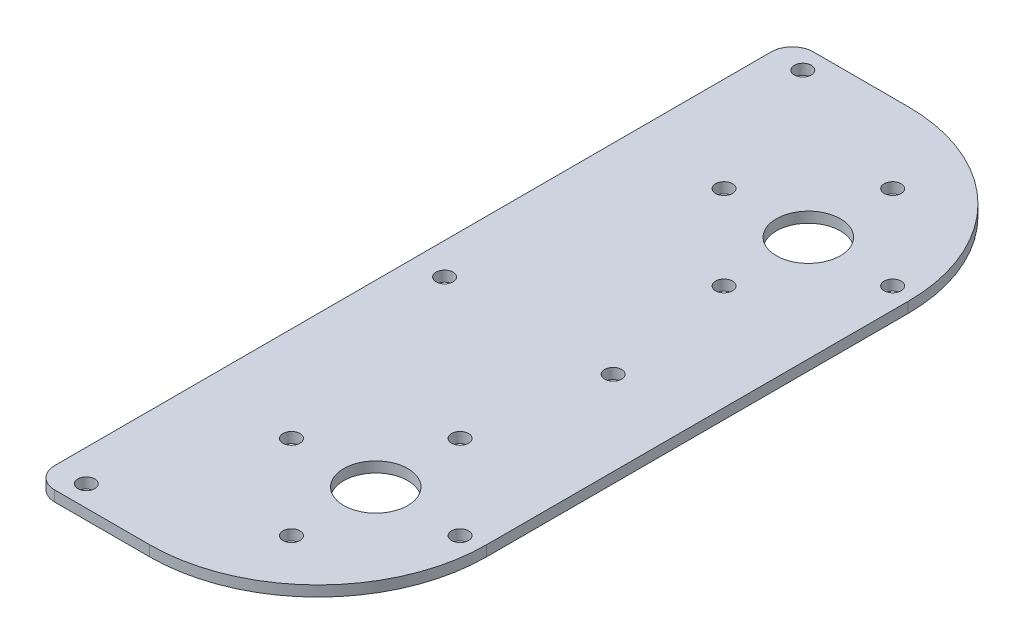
ISO-10303-21;
HEADER;
FILE_DESCRIPTION(('STEP AP214'),'2;1');
FILE_NAME('part.step','',(''),(''),'','','');
FILE_SCHEMA(('AUTOMOTIVE_DESIGN { 1 0 10303 214 1 1 1 1 }'));
ENDSEC;
DATA;
#1=APPLICATION_CONTEXT('core data for automotive mechanical design processes');
#2=APPLICATION_PROTOCOL_DEFINITION('international standard','automotive_design',2000,#1);
#3=PRODUCT_CONTEXT('',#1,'mechanical');
#4=PRODUCT('Part','Part','',(#3));
#5=PRODUCT_RELATED_PRODUCT_CATEGORY('part','',(#4));
#6=PRODUCT_DEFINITION_FORMATION('','',#4);
#7=PRODUCT_DEFINITION_CONTEXT('part definition',#1,'design');
#8=PRODUCT_DEFINITION('design','',#6,#7);
#9=PRODUCT_DEFINITION_SHAPE('','',#8);
#10=(LENGTH_UNIT() NAMED_UNIT(*) SI_UNIT(.MILLI.,.METRE.));
#11=(NAMED_UNIT(*) PLANE_ANGLE_UNIT() SI_UNIT($,.RADIAN.));
#12=(NAMED_UNIT(*) SI_UNIT($,.STERADIAN.) SOLID_ANGLE_UNIT());
#13=UNCERTAINTY_MEASURE_WITH_UNIT(LENGTH_MEASURE(1.E-05),#10,'distance_accuracy_value','');
#14=(GEOMETRIC_REPRESENTATION_CONTEXT(3) GLOBAL_UNCERTAINTY_ASSIGNED_CONTEXT((#13)) GLOBAL_UNIT_ASSIGNED_CONTEXT((#10,
#11,#12)) REPRESENTATION_CONTEXT('',''));
#15=CARTESIAN_POINT('',(0.,0.,0.));
#16=DIRECTION('',(0.,0.,1.));
#17=DIRECTION('',(1.,0.,0.));
#18=AXIS2_PLACEMENT_3D('',#15,#16,#17);
#19=CARTESIAN_POINT('',(6.35,3.175,-6.35));
#20=DIRECTION('',(0.,1.,0.));
#21=DIRECTION('',(0.,0.,1.));
#22=AXIS2_PLACEMENT_3D('',#19,#20,#21);
#23=PLANE('',#22);
#24=DIRECTION('',(0.,0.,-1.));
#25=VECTOR('',#24,1.);
#26=CARTESIAN_POINT('',(9.525,3.175,-228.6));
#27=LINE('',#26,#25);
#28=CARTESIAN_POINT('',(9.52500000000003,3.175,-6.34999999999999));
#29=VERTEX_POINT('',#28);
#30=CARTESIAN_POINT('',(9.525,3.175,-222.25));
#31=VERTEX_POINT('',#30);
#32=EDGE_CURVE('E198',#29,#31,#27,.T.);
#33=ORIENTED_EDGE('',*,*,#32,.F.);
#34=CARTESIAN_POINT('',(15.875,3.175,-6.34999999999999));
#35=DIRECTION('',(0.,1.,0.));
#36=DIRECTION('',(0.,0.,1.));
#37=AXIS2_PLACEMENT_3D('',#34,#35,#36);
#38=CIRCLE('',#37,6.35);
#39=CARTESIAN_POINT('',(15.875,3.175,0.));
#40=VERTEX_POINT('',#39);
#41=EDGE_CURVE('E122',#29,#40,#38,.T.);
#42=ORIENTED_EDGE('',*,*,#41,.T.);
#43=DIRECTION('',(1.,0.,0.));
#44=VECTOR('',#43,1.);
#45=CARTESIAN_POINT('',(6.35000000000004,3.175,0.));
#46=LINE('',#45,#44);
#47=CARTESIAN_POINT('',(44.45,3.175,0.));
#48=VERTEX_POINT('',#47);
#49=EDGE_CURVE('E115',#40,#48,#46,.T.);
#50=ORIENTED_EDGE('',*,*,#49,.T.);
#51=CARTESIAN_POINT('',(44.45,3.175,-50.8));
#52=DIRECTION('',(0.,1.,0.));
#53=DIRECTION('',(0.,0.,1.));
#54=AXIS2_PLACEMENT_3D('',#51,#52,#53);
#55=CIRCLE('',#54,50.8);
#56=CARTESIAN_POINT('',(95.25,3.175,-50.8));
#57=VERTEX_POINT('',#56);
#58=EDGE_CURVE('E120',#48,#57,#55,.T.);
#59=ORIENTED_EDGE('',*,*,#58,.T.);
#60=DIRECTION('',(0.,0.,-1.));
#61=VECTOR('',#60,1.);
#62=CARTESIAN_POINT('',(95.25,3.175,-50.8));
#63=LINE('',#62,#61);
#64=CARTESIAN_POINT('',(95.25,3.175,-177.8));
#65=VERTEX_POINT('',#64);
#66=EDGE_CURVE('E140',#57,#65,#63,.T.);
#67=ORIENTED_EDGE('',*,*,#66,.T.);
#68=CARTESIAN_POINT('',(44.45,3.175,-177.8));
#69=DIRECTION('',(0.,1.,0.));
#70=DIRECTION('',(0.,0.,1.));
#71=AXIS2_PLACEMENT_3D('',#68,#69,#70);
#72=CIRCLE('',#71,50.8);
#73=CARTESIAN_POINT('',(44.45,3.175,-228.6));
#74=VERTEX_POINT('',#73);
#75=EDGE_CURVE('E145',#65,#74,#72,.T.);
#76=ORIENTED_EDGE('',*,*,#75,.T.);
#77=DIRECTION('',(-1.,0.,0.));
#78=VECTOR('',#77,1.);
#79=CARTESIAN_POINT('',(6.35,3.175,-228.6));
#80=LINE('',#79,#78);
#81=CARTESIAN_POINT('',(15.875,3.175,-228.6));
#82=VERTEX_POINT('',#81);
#83=EDGE_CURVE('E151',#74,#82,#80,.T.);
#84=ORIENTED_EDGE('',*,*,#83,.T.);
#85=CARTESIAN_POINT('',(15.875,3.175,-222.25));
#86=DIRECTION('',(0.,1.,0.));
#87=DIRECTION('',(0.,0.,1.));
#88=AXIS2_PLACEMENT_3D('',#85,#86,#87);
#89=CIRCLE('',#88,6.35);
#90=EDGE_CURVE('E182',#82,#31,#89,.T.);
#91=ORIENTED_EDGE('',*,*,#90,.T.);
#92=EDGE_LOOP('',(#33,#42,#50,#59,#67,#76,#84,#91));
#93=FACE_BOUND('',#92,.T.);
#94=CARTESIAN_POINT('',(63.5,3.175,-204.8764));
#95=DIRECTION('',(0.,1.,0.));
#96=DIRECTION('',(0.,0.,1.));
#97=AXIS2_PLACEMENT_3D('',#94,#95,#96);
#98=CIRCLE('',#97,2.55269999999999);
#99=CARTESIAN_POINT('',(63.5,3.175,-202.3237));
#100=VERTEX_POINT('',#99);
#101=EDGE_CURVE('E197',#100,#100,#98,.T.);
#102=ORIENTED_EDGE('',*,*,#101,.F.);
#103=EDGE_LOOP('',(#102));
#104=FACE_BOUND('',#103,.T.);
#105=CARTESIAN_POINT('',(38.1,3.175,-179.4764));
#106=DIRECTION('',(0.,1.,0.));
#107=DIRECTION('',(0.,0.,1.));
#108=AXIS2_PLACEMENT_3D('',#105,#106,#107);
#109=CIRCLE('',#108,2.55269999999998);
#110=CARTESIAN_POINT('',(38.1,3.175,-176.9237));
#111=VERTEX_POINT('',#110);
#112=EDGE_CURVE('E572',#111,#111,#109,.T.);
#113=ORIENTED_EDGE('',*,*,#112,.F.);
#114=EDGE_LOOP('',(#113));
#115=FACE_BOUND('',#114,.T.);
#116=CARTESIAN_POINT('',(88.9,3.175,-179.4764));
#117=DIRECTION('',(0.,1.,0.));
#118=DIRECTION('',(0.,0.,1.));
#119=AXIS2_PLACEMENT_3D('',#116,#117,#118);
#120=CIRCLE('',#119,2.55269999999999);
#121=CARTESIAN_POINT('',(88.9,3.175,-176.9237));
#122=VERTEX_POINT('',#121);
#123=EDGE_CURVE('E564',#122,#122,#120,.T.);
#124=ORIENTED_EDGE('',*,*,#123,.F.);
#125=EDGE_LOOP('',(#124));
#126=FACE_BOUND('',#125,.T.);
#127=CARTESIAN_POINT('',(63.5,3.175,-154.0764));
#128=DIRECTION('',(0.,1.,0.));
#129=DIRECTION('',(0.,0.,1.));
#130=AXIS2_PLACEMENT_3D('',#127,#128,#129);
#131=CIRCLE('',#130,2.55269999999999);
#132=CARTESIAN_POINT('',(63.5,3.175,-151.5237));
#133=VERTEX_POINT('',#132);
#134=EDGE_CURVE('E556',#133,#133,#131,.T.);
#135=ORIENTED_EDGE('',*,*,#134,.F.);
#136=EDGE_LOOP('',(#135));
#137=FACE_BOUND('',#136,.T.);
#138=CARTESIAN_POINT('',(63.5,3.175,-74.5236));
#139=DIRECTION('',(0.,1.,0.));
#140=DIRECTION('',(0.,0.,1.));
#141=AXIS2_PLACEMENT_3D('',#138,#139,#140);
#142=CIRCLE('',#141,2.55269999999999);
#143=CARTESIAN_POINT('',(63.5,3.175,-71.9709));
#144=VERTEX_POINT('',#143);
#145=EDGE_CURVE('E548',#144,#144,#142,.T.);
#146=ORIENTED_EDGE('',*,*,#145,.F.);
#147=EDGE_LOOP('',(#146));
#148=FACE_BOUND('',#147,.T.);
#149=CARTESIAN_POINT('',(38.1,3.175,-49.1236));
#150=DIRECTION('',(0.,1.,0.));
#151=DIRECTION('',(0.,0.,1.));
#152=AXIS2_PLACEMENT_3D('',#149,#150,#151);
#153=CIRCLE('',#152,2.55269999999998);
#154=CARTESIAN_POINT('',(38.1,3.175,-46.5709));
#155=VERTEX_POINT('',#154);
#156=EDGE_CURVE('E540',#155,#155,#153,.T.);
#157=ORIENTED_EDGE('',*,*,#156,.F.);
#158=EDGE_LOOP('',(#157));
#159=FACE_BOUND('',#158,.T.);
#160=CARTESIAN_POINT('',(88.9,3.175,-49.1236));
#161=DIRECTION('',(0.,1.,0.));
#162=DIRECTION('',(0.,0.,1.));
#163=AXIS2_PLACEMENT_3D('',#160,#161,#162);
#164=CIRCLE('',#163,2.55269999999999);
#165=CARTESIAN_POINT('',(88.9,3.175,-46.5709));
#166=VERTEX_POINT('',#165);
#167=EDGE_CURVE('E532',#166,#166,#164,.T.);
#168=ORIENTED_EDGE('',*,*,#167,.F.);
#169=EDGE_LOOP('',(#168));
#170=FACE_BOUND('',#169,.T.);
#171=CARTESIAN_POINT('',(63.5,3.175,-23.7236));
#172=DIRECTION('',(0.,1.,0.));
#173=DIRECTION('',(0.,0.,1.));
#174=AXIS2_PLACEMENT_3D('',#171,#172,#173);
#175=CIRCLE('',#174,2.55269999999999);
#176=CARTESIAN_POINT('',(63.5,3.175,-21.1709));
#177=VERTEX_POINT('',#176);
#178=EDGE_CURVE('E524',#177,#177,#175,.T.);
#179=ORIENTED_EDGE('',*,*,#178,.F.);
#180=EDGE_LOOP('',(#179));
#181=FACE_BOUND('',#180,.T.);
#182=CARTESIAN_POINT('',(19.05,3.175,-222.25));
#183=DIRECTION('',(0.,1.,0.));
#184=DIRECTION('',(0.,0.,1.));
#185=AXIS2_PLACEMENT_3D('',#182,#183,#184);
#186=CIRCLE('',#185,2.55269999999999);
#187=CARTESIAN_POINT('',(19.05,3.175,-219.6973));
#188=VERTEX_POINT('',#187);
#189=EDGE_CURVE('E516',#188,#188,#186,.T.);
#190=ORIENTED_EDGE('',*,*,#189,.F.);
#191=EDGE_LOOP('',(#190));
#192=FACE_BOUND('',#191,.T.);
#193=CARTESIAN_POINT('',(19.05,3.175,-114.3));
#194=DIRECTION('',(0.,1.,0.));
#195=DIRECTION('',(0.,0.,1.));
#196=AXIS2_PLACEMENT_3D('',#193,#194,#195);
#197=CIRCLE('',#196,2.55269999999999);
#198=CARTESIAN_POINT('',(19.05,3.175,-111.7473));
#199=VERTEX_POINT('',#198);
#200=EDGE_CURVE('E508',#199,#199,#197,.T.);
#201=ORIENTED_EDGE('',*,*,#200,.F.);
#202=EDGE_LOOP('',(#201));
#203=FACE_BOUND('',#202,.T.);
#204=CARTESIAN_POINT('',(69.85,3.175,-114.3));
#205=DIRECTION('',(0.,1.,0.));
#206=DIRECTION('',(0.,0.,1.));
#207=AXIS2_PLACEMENT_3D('',#204,#205,#206);
#208=CIRCLE('',#207,2.55269999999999);
#209=CARTESIAN_POINT('',(69.85,3.175,-111.7473));
#210=VERTEX_POINT('',#209);
#211=EDGE_CURVE('E500',#210,#210,#208,.T.);
#212=ORIENTED_EDGE('',*,*,#211,.F.);
#213=EDGE_LOOP('',(#212));
#214=FACE_BOUND('',#213,.T.);
#215=CARTESIAN_POINT('',(19.05,3.175,-6.35));
#216=DIRECTION('',(0.,1.,0.));
#217=DIRECTION('',(0.,0.,1.));
#218=AXIS2_PLACEMENT_3D('',#215,#216,#217);
#219=CIRCLE('',#218,2.55269999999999);
#220=CARTESIAN_POINT('',(19.05,3.175,-3.79730000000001));
#221=VERTEX_POINT('',#220);
#222=EDGE_CURVE('E492',#221,#221,#219,.T.);
#223=ORIENTED_EDGE('',*,*,#222,.F.);
#224=EDGE_LOOP('',(#223));
#225=FACE_BOUND('',#224,.T.);
#226=CARTESIAN_POINT('',(63.5,3.175,-179.4764));
#227=DIRECTION('',(0.,1.,0.));
#228=DIRECTION('',(0.,0.,1.));
#229=AXIS2_PLACEMENT_3D('',#226,#227,#228);
#230=CIRCLE('',#229,9.65199999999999);
#231=CARTESIAN_POINT('',(63.5,3.175,-169.8244));
#232=VERTEX_POINT('',#231);
#233=EDGE_CURVE('E159',#232,#232,#230,.T.);
#234=ORIENTED_EDGE('',*,*,#233,.F.);
#235=EDGE_LOOP('',(#234));
#236=FACE_BOUND('',#235,.T.);
#237=CARTESIAN_POINT('',(63.5,3.175,-49.1236));
#238=DIRECTION('',(0.,1.,0.));
#239=DIRECTION('',(0.,0.,1.));
#240=AXIS2_PLACEMENT_3D('',#237,#238,#239);
#241=CIRCLE('',#240,9.65199999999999);
#242=CARTESIAN_POINT('',(63.5,3.175,-39.4716));
#243=VERTEX_POINT('',#242);
#244=EDGE_CURVE('E476',#243,#243,#241,.T.);
#245=ORIENTED_EDGE('',*,*,#244,.F.);
#246=EDGE_LOOP('',(#245));
#247=FACE_BOUND('',#246,.T.);
#248=ADVANCED_FACE('F49',(#93,#104,#115,#126,#137,#148,#159,#170,#181,#192,#203,#214,#225,#236,
#247),#23,.T.);
#249=CARTESIAN_POINT('',(6.35,0.,-6.35));
#250=DIRECTION('',(0.,1.,0.));
#251=DIRECTION('',(0.,0.,1.));
#252=AXIS2_PLACEMENT_3D('',#249,#250,#251);
#253=PLANE('',#252);
#254=CARTESIAN_POINT('',(63.5,0.,-204.8764));
#255=DIRECTION('',(0.,1.,0.));
#256=DIRECTION('',(0.,0.,1.));
#257=AXIS2_PLACEMENT_3D('',#254,#255,#256);
#258=CIRCLE('',#257,2.55269999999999);
#259=CARTESIAN_POINT('',(63.5,0.,-202.3237));
#260=VERTEX_POINT('',#259);
#261=EDGE_CURVE('E576',#260,#260,#258,.T.);
#262=ORIENTED_EDGE('',*,*,#261,.T.);
#263=EDGE_LOOP('',(#262));
#264=FACE_BOUND('',#263,.T.);
#265=CARTESIAN_POINT('',(38.1,0.,-179.4764));
#266=DIRECTION('',(0.,1.,0.));
#267=DIRECTION('',(0.,0.,1.));
#268=AXIS2_PLACEMENT_3D('',#265,#266,#267);
#269=CIRCLE('',#268,2.5527);
#270=CARTESIAN_POINT('',(38.1,0.,-176.9237));
#271=VERTEX_POINT('',#270);
#272=EDGE_CURVE('E568',#271,#271,#269,.T.);
#273=ORIENTED_EDGE('',*,*,#272,.T.);
#274=EDGE_LOOP('',(#273));
#275=FACE_BOUND('',#274,.T.);
#276=CARTESIAN_POINT('',(88.9,0.,-179.4764));
#277=DIRECTION('',(0.,1.,0.));
#278=DIRECTION('',(0.,0.,1.));
#279=AXIS2_PLACEMENT_3D('',#276,#277,#278);
#280=CIRCLE('',#279,2.55269999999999);
#281=CARTESIAN_POINT('',(88.9,0.,-176.9237));
#282=VERTEX_POINT('',#281);
#283=EDGE_CURVE('E560',#282,#282,#280,.T.);
#284=ORIENTED_EDGE('',*,*,#283,.T.);
#285=EDGE_LOOP('',(#284));
#286=FACE_BOUND('',#285,.T.);
#287=CARTESIAN_POINT('',(63.5,0.,-154.0764));
#288=DIRECTION('',(0.,1.,0.));
#289=DIRECTION('',(0.,0.,1.));
#290=AXIS2_PLACEMENT_3D('',#287,#288,#289);
#291=CIRCLE('',#290,2.55269999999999);
#292=CARTESIAN_POINT('',(63.5,0.,-151.5237));
#293=VERTEX_POINT('',#292);
#294=EDGE_CURVE('E552',#293,#293,#291,.T.);
#295=ORIENTED_EDGE('',*,*,#294,.T.);
#296=EDGE_LOOP('',(#295));
#297=FACE_BOUND('',#296,.T.);
#298=CARTESIAN_POINT('',(63.5,0.,-74.5236));
#299=DIRECTION('',(0.,1.,0.));
#300=DIRECTION('',(0.,0.,1.));
#301=AXIS2_PLACEMENT_3D('',#298,#299,#300);
#302=CIRCLE('',#301,2.55269999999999);
#303=CARTESIAN_POINT('',(63.5,0.,-71.9709));
#304=VERTEX_POINT('',#303);
#305=EDGE_CURVE('E544',#304,#304,#302,.T.);
#306=ORIENTED_EDGE('',*,*,#305,.T.);
#307=EDGE_LOOP('',(#306));
#308=FACE_BOUND('',#307,.T.);
#309=CARTESIAN_POINT('',(38.1,0.,-49.1236));
#310=DIRECTION('',(0.,1.,0.));
#311=DIRECTION('',(0.,0.,1.));
#312=AXIS2_PLACEMENT_3D('',#309,#310,#311);
#313=CIRCLE('',#312,2.5527);
#314=CARTESIAN_POINT('',(38.1,0.,-46.5709));
#315=VERTEX_POINT('',#314);
#316=EDGE_CURVE('E536',#315,#315,#313,.T.);
#317=ORIENTED_EDGE('',*,*,#316,.T.);
#318=EDGE_LOOP('',(#317));
#319=FACE_BOUND('',#318,.T.);
#320=CARTESIAN_POINT('',(88.9,0.,-49.1236));
#321=DIRECTION('',(0.,1.,0.));
#322=DIRECTION('',(0.,0.,1.));
#323=AXIS2_PLACEMENT_3D('',#320,#321,#322);
#324=CIRCLE('',#323,2.55269999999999);
#325=CARTESIAN_POINT('',(88.9,0.,-46.5709));
#326=VERTEX_POINT('',#325);
#327=EDGE_CURVE('E528',#326,#326,#324,.T.);
#328=ORIENTED_EDGE('',*,*,#327,.T.);
#329=EDGE_LOOP('',(#328));
#330=FACE_BOUND('',#329,.T.);
#331=CARTESIAN_POINT('',(63.5,0.,-23.7236));
#332=DIRECTION('',(0.,1.,0.));
#333=DIRECTION('',(0.,0.,1.));
#334=AXIS2_PLACEMENT_3D('',#331,#332,#333);
#335=CIRCLE('',#334,2.55269999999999);
#336=CARTESIAN_POINT('',(63.5,0.,-21.1709));
#337=VERTEX_POINT('',#336);
#338=EDGE_CURVE('E520',#337,#337,#335,.T.);
#339=ORIENTED_EDGE('',*,*,#338,.T.);
#340=EDGE_LOOP('',(#339));
#341=FACE_BOUND('',#340,.T.);
#342=CARTESIAN_POINT('',(19.05,0.,-222.25));
#343=DIRECTION('',(0.,1.,0.));
#344=DIRECTION('',(0.,0.,1.));
#345=AXIS2_PLACEMENT_3D('',#342,#343,#344);
#346=CIRCLE('',#345,2.55269999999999);
#347=CARTESIAN_POINT('',(19.05,0.,-219.6973));
#348=VERTEX_POINT('',#347);
#349=EDGE_CURVE('E512',#348,#348,#346,.T.);
#350=ORIENTED_EDGE('',*,*,#349,.T.);
#351=EDGE_LOOP('',(#350));
#352=FACE_BOUND('',#351,.T.);
#353=CARTESIAN_POINT('',(19.05,0.,-114.3));
#354=DIRECTION('',(0.,1.,0.));
#355=DIRECTION('',(0.,0.,1.));
#356=AXIS2_PLACEMENT_3D('',#353,#354,#355);
#357=CIRCLE('',#356,2.55269999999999);
#358=CARTESIAN_POINT('',(19.05,0.,-111.7473));
#359=VERTEX_POINT('',#358);
#360=EDGE_CURVE('E504',#359,#359,#357,.T.);
#361=ORIENTED_EDGE('',*,*,#360,.T.);
#362=EDGE_LOOP('',(#361));
#363=FACE_BOUND('',#362,.T.);
#364=CARTESIAN_POINT('',(69.85,0.,-114.3));
#365=DIRECTION('',(0.,1.,0.));
#366=DIRECTION('',(0.,0.,1.));
#367=AXIS2_PLACEMENT_3D('',#364,#365,#366);
#368=CIRCLE('',#367,2.55269999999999);
#369=CARTESIAN_POINT('',(69.85,0.,-111.7473));
#370=VERTEX_POINT('',#369);
#371=EDGE_CURVE('E496',#370,#370,#368,.T.);
#372=ORIENTED_EDGE('',*,*,#371,.T.);
#373=EDGE_LOOP('',(#372));
#374=FACE_BOUND('',#373,.T.);
#375=CARTESIAN_POINT('',(19.05,0.,-6.35));
#376=DIRECTION('',(0.,1.,0.));
#377=DIRECTION('',(0.,0.,1.));
#378=AXIS2_PLACEMENT_3D('',#375,#376,#377);
#379=CIRCLE('',#378,2.55269999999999);
#380=CARTESIAN_POINT('',(19.05,0.,-3.79730000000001));
#381=VERTEX_POINT('',#380);
#382=EDGE_CURVE('E487',#381,#381,#379,.T.);
#383=ORIENTED_EDGE('',*,*,#382,.T.);
#384=EDGE_LOOP('',(#383));
#385=FACE_BOUND('',#384,.T.);
#386=DIRECTION('',(1.,0.,0.));
#387=VECTOR('',#386,1.);
#388=CARTESIAN_POINT('',(6.35000000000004,0.,0.));
#389=LINE('',#388,#387);
#390=CARTESIAN_POINT('',(15.875,0.,0.));
#391=VERTEX_POINT('',#390);
#392=CARTESIAN_POINT('',(44.45,0.,0.));
#393=VERTEX_POINT('',#392);
#394=EDGE_CURVE('E129',#391,#393,#389,.T.);
#395=ORIENTED_EDGE('',*,*,#394,.F.);
#396=CARTESIAN_POINT('',(15.875,0.,-6.34999999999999));
#397=DIRECTION('',(0.,1.,0.));
#398=DIRECTION('',(0.,0.,1.));
#399=AXIS2_PLACEMENT_3D('',#396,#397,#398);
#400=CIRCLE('',#399,6.35);
#401=CARTESIAN_POINT('',(9.52500000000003,0.,-6.34999999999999));
#402=VERTEX_POINT('',#401);
#403=EDGE_CURVE('E57',#391,#402,#400,.F.);
#404=ORIENTED_EDGE('',*,*,#403,.T.);
#405=DIRECTION('',(0.,0.,-1.));
#406=VECTOR('',#405,1.);
#407=CARTESIAN_POINT('',(9.525,0.,-228.6));
#408=LINE('',#407,#406);
#409=CARTESIAN_POINT('',(9.525,0.,-222.25));
#410=VERTEX_POINT('',#409);
#411=EDGE_CURVE('E190',#402,#410,#408,.T.);
#412=ORIENTED_EDGE('',*,*,#411,.T.);
#413=CARTESIAN_POINT('',(15.875,0.,-222.25));
#414=DIRECTION('',(0.,1.,0.));
#415=DIRECTION('',(0.,0.,1.));
#416=AXIS2_PLACEMENT_3D('',#413,#414,#415);
#417=CIRCLE('',#416,6.35);
#418=CARTESIAN_POINT('',(15.875,0.,-228.6));
#419=VERTEX_POINT('',#418);
#420=EDGE_CURVE('E64',#410,#419,#417,.F.);
#421=ORIENTED_EDGE('',*,*,#420,.T.);
#422=DIRECTION('',(-1.,0.,0.));
#423=VECTOR('',#422,1.);
#424=CARTESIAN_POINT('',(6.35,0.,-228.6));
#425=LINE('',#424,#423);
#426=CARTESIAN_POINT('',(44.45,0.,-228.6));
#427=VERTEX_POINT('',#426);
#428=EDGE_CURVE('E124',#427,#419,#425,.T.);
#429=ORIENTED_EDGE('',*,*,#428,.F.);
#430=CARTESIAN_POINT('',(44.45,0.,-177.8));
#431=DIRECTION('',(0.,1.,0.));
#432=DIRECTION('',(0.,0.,1.));
#433=AXIS2_PLACEMENT_3D('',#430,#431,#432);
#434=CIRCLE('',#433,50.8);
#435=CARTESIAN_POINT('',(95.25,0.,-177.8));
#436=VERTEX_POINT('',#435);
#437=EDGE_CURVE('E165',#436,#427,#434,.T.);
#438=ORIENTED_EDGE('',*,*,#437,.F.);
#439=DIRECTION('',(0.,0.,-1.));
#440=VECTOR('',#439,1.);
#441=CARTESIAN_POINT('',(95.25,0.,-50.8));
#442=LINE('',#441,#440);
#443=CARTESIAN_POINT('',(95.25,0.,-50.8));
#444=VERTEX_POINT('',#443);
#445=EDGE_CURVE('E162',#444,#436,#442,.T.);
#446=ORIENTED_EDGE('',*,*,#445,.F.);
#447=CARTESIAN_POINT('',(44.45,0.,-50.8));
#448=DIRECTION('',(0.,1.,0.));
#449=DIRECTION('',(0.,0.,1.));
#450=AXIS2_PLACEMENT_3D('',#447,#448,#449);
#451=CIRCLE('',#450,50.8);
#452=EDGE_CURVE('E158',#393,#444,#451,.T.);
#453=ORIENTED_EDGE('',*,*,#452,.F.);
#454=EDGE_LOOP('',(#395,#404,#412,#421,#429,#438,#446,#453));
#455=FACE_BOUND('',#454,.T.);
#456=CARTESIAN_POINT('',(63.5,0.,-179.4764));
#457=DIRECTION('',(0.,1.,0.));
#458=DIRECTION('',(0.,0.,1.));
#459=AXIS2_PLACEMENT_3D('',#456,#457,#458);
#460=CIRCLE('',#459,9.65199999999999);
#461=CARTESIAN_POINT('',(63.5,0.,-169.8244));
#462=VERTEX_POINT('',#461);
#463=EDGE_CURVE('E474',#462,#462,#460,.T.);
#464=ORIENTED_EDGE('',*,*,#463,.T.);
#465=EDGE_LOOP('',(#464));
#466=FACE_BOUND('',#465,.T.);
#467=CARTESIAN_POINT('',(63.5,0.,-49.1236));
#468=DIRECTION('',(0.,1.,0.));
#469=DIRECTION('',(0.,0.,1.));
#470=AXIS2_PLACEMENT_3D('',#467,#468,#469);
#471=CIRCLE('',#470,9.65199999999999);
#472=CARTESIAN_POINT('',(63.5,0.,-39.4716));
#473=VERTEX_POINT('',#472);
#474=EDGE_CURVE('E482',#473,#473,#471,.T.);
#475=ORIENTED_EDGE('',*,*,#474,.T.);
#476=EDGE_LOOP('',(#475));
#477=FACE_BOUND('',#476,.T.);
#478=ADVANCED_FACE('F188',(#264,#275,#286,#297,#308,#319,#330,#341,#352,#363,#374,#385,#455,
#466,#477),#253,.F.);
#479=CARTESIAN_POINT('',(6.35000000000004,3.175,0.));
#480=DIRECTION('',(0.,0.,-1.));
#481=DIRECTION('',(-1.,0.,0.));
#482=AXIS2_PLACEMENT_3D('',#479,#480,#481);
#483=PLANE('',#482);
#484=ORIENTED_EDGE('',*,*,#49,.F.);
#485=DIRECTION('',(0.,1.,0.));
#486=VECTOR('',#485,1.);
#487=CARTESIAN_POINT('',(15.875,3.175,0.));
#488=LINE('',#487,#486);
#489=EDGE_CURVE('E72',#40,#391,#488,.F.);
#490=ORIENTED_EDGE('',*,*,#489,.T.);
#491=ORIENTED_EDGE('',*,*,#394,.T.);
#492=DIRECTION('',(0.,-1.,0.));
#493=VECTOR('',#492,1.);
#494=CARTESIAN_POINT('',(44.45,3.175,0.));
#495=LINE('',#494,#493);
#496=EDGE_CURVE('E127',#48,#393,#495,.T.);
#497=ORIENTED_EDGE('',*,*,#496,.F.);
#498=EDGE_LOOP('',(#484,#490,#491,#497));
#499=FACE_BOUND('',#498,.T.);
#500=ADVANCED_FACE('F128',(#499),#483,.F.);
#501=CARTESIAN_POINT('',(44.45,3.175,-50.8));
#502=DIRECTION('',(0.,-1.,0.));
#503=DIRECTION('',(0.,0.,-1.));
#504=AXIS2_PLACEMENT_3D('',#501,#502,#503);
#505=CYLINDRICAL_SURFACE('',#504,50.8);
#506=ORIENTED_EDGE('',*,*,#452,.T.);
#507=DIRECTION('',(0.,-1.,0.));
#508=VECTOR('',#507,1.);
#509=CARTESIAN_POINT('',(95.25,3.175,-50.8));
#510=LINE('',#509,#508);
#511=EDGE_CURVE('E134',#57,#444,#510,.T.);
#512=ORIENTED_EDGE('',*,*,#511,.F.);
#513=ORIENTED_EDGE('',*,*,#58,.F.);
#514=ORIENTED_EDGE('',*,*,#496,.T.);
#515=EDGE_LOOP('',(#506,#512,#513,#514));
#516=FACE_BOUND('',#515,.T.);
#517=ADVANCED_FACE('F136',(#516),#505,.T.);
#518=CARTESIAN_POINT('',(95.25,3.175,-50.8));
#519=DIRECTION('',(-1.,0.,0.));
#520=DIRECTION('',(0.,0.,1.));
#521=AXIS2_PLACEMENT_3D('',#518,#519,#520);
#522=PLANE('',#521);
#523=ORIENTED_EDGE('',*,*,#445,.T.);
#524=DIRECTION('',(0.,-1.,0.));
#525=VECTOR('',#524,1.);
#526=CARTESIAN_POINT('',(95.25,3.175,-177.8));
#527=LINE('',#526,#525);
#528=EDGE_CURVE('E172',#65,#436,#527,.T.);
#529=ORIENTED_EDGE('',*,*,#528,.F.);
#530=ORIENTED_EDGE('',*,*,#66,.F.);
#531=ORIENTED_EDGE('',*,*,#511,.T.);
#532=EDGE_LOOP('',(#523,#529,#530,#531));
#533=FACE_BOUND('',#532,.T.);
#534=ADVANCED_FACE('F229',(#533),#522,.F.);
#535=CARTESIAN_POINT('',(44.45,3.175,-177.8));
#536=DIRECTION('',(0.,-1.,0.));
#537=DIRECTION('',(0.,0.,-1.));
#538=AXIS2_PLACEMENT_3D('',#535,#536,#537);
#539=CYLINDRICAL_SURFACE('',#538,50.8);
#540=ORIENTED_EDGE('',*,*,#437,.T.);
#541=DIRECTION('',(0.,-1.,0.));
#542=VECTOR('',#541,1.);
#543=CARTESIAN_POINT('',(44.45,3.175,-228.6));
#544=LINE('',#543,#542);
#545=EDGE_CURVE('E155',#74,#427,#544,.T.);
#546=ORIENTED_EDGE('',*,*,#545,.F.);
#547=ORIENTED_EDGE('',*,*,#75,.F.);
#548=ORIENTED_EDGE('',*,*,#528,.T.);
#549=EDGE_LOOP('',(#540,#546,#547,#548));
#550=FACE_BOUND('',#549,.T.);
#551=ADVANCED_FACE('F225',(#550),#539,.T.);
#552=CARTESIAN_POINT('',(6.35,3.175,-228.6));
#553=DIRECTION('',(0.,0.,1.));
#554=DIRECTION('',(1.,0.,0.));
#555=AXIS2_PLACEMENT_3D('',#552,#553,#554);
#556=PLANE('',#555);
#557=ORIENTED_EDGE('',*,*,#428,.T.);
#558=DIRECTION('',(0.,1.,0.));
#559=VECTOR('',#558,1.);
#560=CARTESIAN_POINT('',(15.875,3.175,-228.6));
#561=LINE('',#560,#559);
#562=EDGE_CURVE('E13',#419,#82,#561,.T.);
#563=ORIENTED_EDGE('',*,*,#562,.T.);
#564=ORIENTED_EDGE('',*,*,#83,.F.);
#565=ORIENTED_EDGE('',*,*,#545,.T.);
#566=EDGE_LOOP('',(#557,#563,#564,#565));
#567=FACE_BOUND('',#566,.T.);
#568=ADVANCED_FACE('F222',(#567),#556,.F.);
#569=CARTESIAN_POINT('',(63.5,3.175,-179.4764));
#570=DIRECTION('',(0.,-1.,0.));
#571=DIRECTION('',(0.,0.,-1.));
#572=AXIS2_PLACEMENT_3D('',#569,#570,#571);
#573=CYLINDRICAL_SURFACE('',#572,9.65199999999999);
#574=ORIENTED_EDGE('',*,*,#233,.T.);
#575=EDGE_LOOP('',(#574));
#576=FACE_BOUND('',#575,.T.);
#577=ORIENTED_EDGE('',*,*,#463,.F.);
#578=EDGE_LOOP('',(#577));
#579=FACE_BOUND('',#578,.T.);
#580=ADVANCED_FACE('F219',(#576,#579),#573,.F.);
#581=CARTESIAN_POINT('',(63.5,3.175,-49.1236));
#582=DIRECTION('',(0.,-1.,0.));
#583=DIRECTION('',(0.,0.,-1.));
#584=AXIS2_PLACEMENT_3D('',#581,#582,#583);
#585=CYLINDRICAL_SURFACE('',#584,9.65199999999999);
#586=ORIENTED_EDGE('',*,*,#244,.T.);
#587=EDGE_LOOP('',(#586));
#588=FACE_BOUND('',#587,.T.);
#589=ORIENTED_EDGE('',*,*,#474,.F.);
#590=EDGE_LOOP('',(#589));
#591=FACE_BOUND('',#590,.T.);
#592=ADVANCED_FACE('F355',(#588,#591),#585,.F.);
#593=CARTESIAN_POINT('',(19.05,3.175,-6.35));
#594=DIRECTION('',(0.,1.,0.));
#595=DIRECTION('',(0.,0.,1.));
#596=AXIS2_PLACEMENT_3D('',#593,#594,#595);
#597=CYLINDRICAL_SURFACE('',#596,2.55269999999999);
#598=ORIENTED_EDGE('',*,*,#382,.F.);
#599=EDGE_LOOP('',(#598));
#600=FACE_BOUND('',#599,.T.);
#601=ORIENTED_EDGE('',*,*,#222,.T.);
#602=EDGE_LOOP('',(#601));
#603=FACE_BOUND('',#602,.T.);
#604=ADVANCED_FACE('F347',(#600,#603),#597,.F.);
#605=CARTESIAN_POINT('',(69.85,3.175,-114.3));
#606=DIRECTION('',(0.,1.,0.));
#607=DIRECTION('',(0.,0.,1.));
#608=AXIS2_PLACEMENT_3D('',#605,#606,#607);
#609=CYLINDRICAL_SURFACE('',#608,2.55269999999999);
#610=ORIENTED_EDGE('',*,*,#371,.F.);
#611=EDGE_LOOP('',(#610));
#612=FACE_BOUND('',#611,.T.);
#613=ORIENTED_EDGE('',*,*,#211,.T.);
#614=EDGE_LOOP('',(#613));
#615=FACE_BOUND('',#614,.T.);
#616=ADVANCED_FACE('F339',(#612,#615),#609,.F.);
#617=CARTESIAN_POINT('',(19.05,3.175,-114.3));
#618=DIRECTION('',(0.,1.,0.));
#619=DIRECTION('',(0.,0.,1.));
#620=AXIS2_PLACEMENT_3D('',#617,#618,#619);
#621=CYLINDRICAL_SURFACE('',#620,2.55269999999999);
#622=ORIENTED_EDGE('',*,*,#360,.F.);
#623=EDGE_LOOP('',(#622));
#624=FACE_BOUND('',#623,.T.);
#625=ORIENTED_EDGE('',*,*,#200,.T.);
#626=EDGE_LOOP('',(#625));
#627=FACE_BOUND('',#626,.T.);
#628=ADVANCED_FACE('F331',(#624,#627),#621,.F.);
#629=CARTESIAN_POINT('',(19.05,3.175,-222.25));
#630=DIRECTION('',(0.,1.,0.));
#631=DIRECTION('',(0.,0.,1.));
#632=AXIS2_PLACEMENT_3D('',#629,#630,#631);
#633=CYLINDRICAL_SURFACE('',#632,2.55269999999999);
#634=ORIENTED_EDGE('',*,*,#349,.F.);
#635=EDGE_LOOP('',(#634));
#636=FACE_BOUND('',#635,.T.);
#637=ORIENTED_EDGE('',*,*,#189,.T.);
#638=EDGE_LOOP('',(#637));
#639=FACE_BOUND('',#638,.T.);
#640=ADVANCED_FACE('F323',(#636,#639),#633,.F.);
#641=CARTESIAN_POINT('',(63.5,3.175,-23.7236));
#642=DIRECTION('',(0.,1.,0.));
#643=DIRECTION('',(0.,0.,1.));
#644=AXIS2_PLACEMENT_3D('',#641,#642,#643);
#645=CYLINDRICAL_SURFACE('',#644,2.55269999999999);
#646=ORIENTED_EDGE('',*,*,#338,.F.);
#647=EDGE_LOOP('',(#646));
#648=FACE_BOUND('',#647,.T.);
#649=ORIENTED_EDGE('',*,*,#178,.T.);
#650=EDGE_LOOP('',(#649));
#651=FACE_BOUND('',#650,.T.);
#652=ADVANCED_FACE('F315',(#648,#651),#645,.F.);
#653=CARTESIAN_POINT('',(88.9,3.175,-49.1236));
#654=DIRECTION('',(0.,1.,0.));
#655=DIRECTION('',(0.,0.,1.));
#656=AXIS2_PLACEMENT_3D('',#653,#654,#655);
#657=CYLINDRICAL_SURFACE('',#656,2.55269999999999);
#658=ORIENTED_EDGE('',*,*,#327,.F.);
#659=EDGE_LOOP('',(#658));
#660=FACE_BOUND('',#659,.T.);
#661=ORIENTED_EDGE('',*,*,#167,.T.);
#662=EDGE_LOOP('',(#661));
#663=FACE_BOUND('',#662,.T.);
#664=ADVANCED_FACE('F307',(#660,#663),#657,.F.);
#665=CARTESIAN_POINT('',(38.1,3.175,-49.1236));
#666=DIRECTION('',(0.,1.,0.));
#667=DIRECTION('',(0.,0.,1.));
#668=AXIS2_PLACEMENT_3D('',#665,#666,#667);
#669=CYLINDRICAL_SURFACE('',#668,2.55269999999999);
#670=ORIENTED_EDGE('',*,*,#316,.F.);
#671=EDGE_LOOP('',(#670));
#672=FACE_BOUND('',#671,.T.);
#673=ORIENTED_EDGE('',*,*,#156,.T.);
#674=EDGE_LOOP('',(#673));
#675=FACE_BOUND('',#674,.T.);
#676=ADVANCED_FACE('F299',(#672,#675),#669,.F.);
#677=CARTESIAN_POINT('',(63.5,3.175,-74.5236));
#678=DIRECTION('',(0.,1.,0.));
#679=DIRECTION('',(0.,0.,1.));
#680=AXIS2_PLACEMENT_3D('',#677,#678,#679);
#681=CYLINDRICAL_SURFACE('',#680,2.55269999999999);
#682=ORIENTED_EDGE('',*,*,#305,.F.);
#683=EDGE_LOOP('',(#682));
#684=FACE_BOUND('',#683,.T.);
#685=ORIENTED_EDGE('',*,*,#145,.T.);
#686=EDGE_LOOP('',(#685));
#687=FACE_BOUND('',#686,.T.);
#688=ADVANCED_FACE('F291',(#684,#687),#681,.F.);
#689=CARTESIAN_POINT('',(63.5,3.175,-154.0764));
#690=DIRECTION('',(0.,1.,0.));
#691=DIRECTION('',(0.,0.,1.));
#692=AXIS2_PLACEMENT_3D('',#689,#690,#691);
#693=CYLINDRICAL_SURFACE('',#692,2.55269999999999);
#694=ORIENTED_EDGE('',*,*,#294,.F.);
#695=EDGE_LOOP('',(#694));
#696=FACE_BOUND('',#695,.T.);
#697=ORIENTED_EDGE('',*,*,#134,.T.);
#698=EDGE_LOOP('',(#697));
#699=FACE_BOUND('',#698,.T.);
#700=ADVANCED_FACE('F283',(#696,#699),#693,.F.);
#701=CARTESIAN_POINT('',(88.9,3.175,-179.4764));
#702=DIRECTION('',(0.,1.,0.));
#703=DIRECTION('',(0.,0.,1.));
#704=AXIS2_PLACEMENT_3D('',#701,#702,#703);
#705=CYLINDRICAL_SURFACE('',#704,2.55269999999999);
#706=ORIENTED_EDGE('',*,*,#283,.F.);
#707=EDGE_LOOP('',(#706));
#708=FACE_BOUND('',#707,.T.);
#709=ORIENTED_EDGE('',*,*,#123,.T.);
#710=EDGE_LOOP('',(#709));
#711=FACE_BOUND('',#710,.T.);
#712=ADVANCED_FACE('F275',(#708,#711),#705,.F.);
#713=CARTESIAN_POINT('',(38.1,3.175,-179.4764));
#714=DIRECTION('',(0.,1.,0.));
#715=DIRECTION('',(0.,0.,1.));
#716=AXIS2_PLACEMENT_3D('',#713,#714,#715);
#717=CYLINDRICAL_SURFACE('',#716,2.55269999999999);
#718=ORIENTED_EDGE('',*,*,#272,.F.);
#719=EDGE_LOOP('',(#718));
#720=FACE_BOUND('',#719,.T.);
#721=ORIENTED_EDGE('',*,*,#112,.T.);
#722=EDGE_LOOP('',(#721));
#723=FACE_BOUND('',#722,.T.);
#724=ADVANCED_FACE('F268',(#720,#723),#717,.F.);
#725=CARTESIAN_POINT('',(63.5,3.175,-204.8764));
#726=DIRECTION('',(0.,1.,0.));
#727=DIRECTION('',(0.,0.,1.));
#728=AXIS2_PLACEMENT_3D('',#725,#726,#727);
#729=CYLINDRICAL_SURFACE('',#728,2.55269999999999);
#730=ORIENTED_EDGE('',*,*,#261,.F.);
#731=EDGE_LOOP('',(#730));
#732=FACE_BOUND('',#731,.T.);
#733=ORIENTED_EDGE('',*,*,#101,.T.);
#734=EDGE_LOOP('',(#733));
#735=FACE_BOUND('',#734,.T.);
#736=ADVANCED_FACE('F207',(#732,#735),#729,.F.);
#737=CARTESIAN_POINT('',(9.525,0.,-228.6));
#738=DIRECTION('',(1.,0.,0.));
#739=DIRECTION('',(0.,0.,-1.));
#740=AXIS2_PLACEMENT_3D('',#737,#738,#739);
#741=PLANE('',#740);
#742=ORIENTED_EDGE('',*,*,#411,.F.);
#743=DIRECTION('',(0.,1.,0.));
#744=VECTOR('',#743,1.);
#745=CARTESIAN_POINT('',(9.52500000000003,0.,-6.34999999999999));
#746=LINE('',#745,#744);
#747=EDGE_CURVE('E179',#402,#29,#746,.T.);
#748=ORIENTED_EDGE('',*,*,#747,.T.);
#749=ORIENTED_EDGE('',*,*,#32,.T.);
#750=DIRECTION('',(0.,1.,0.));
#751=VECTOR('',#750,1.);
#752=CARTESIAN_POINT('',(9.525,0.,-222.25));
#753=LINE('',#752,#751);
#754=EDGE_CURVE('E133',#31,#410,#753,.F.);
#755=ORIENTED_EDGE('',*,*,#754,.T.);
#756=EDGE_LOOP('',(#742,#748,#749,#755));
#757=FACE_BOUND('',#756,.T.);
#758=ADVANCED_FACE('F194',(#757),#741,.F.);
#759=CARTESIAN_POINT('',(15.875,0.,-6.34999999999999));
#760=DIRECTION('',(0.,1.,0.));
#761=DIRECTION('',(0.,0.,1.));
#762=AXIS2_PLACEMENT_3D('',#759,#760,#761);
#763=CYLINDRICAL_SURFACE('',#762,6.35);
#764=ORIENTED_EDGE('',*,*,#403,.F.);
#765=ORIENTED_EDGE('',*,*,#489,.F.);
#766=ORIENTED_EDGE('',*,*,#41,.F.);
#767=ORIENTED_EDGE('',*,*,#747,.F.);
#768=EDGE_LOOP('',(#764,#765,#766,#767));
#769=FACE_BOUND('',#768,.T.);
#770=ADVANCED_FACE('F200',(#769),#763,.T.);
#771=CARTESIAN_POINT('',(15.875,3.175,-222.25));
#772=DIRECTION('',(0.,1.,0.));
#773=DIRECTION('',(0.,0.,1.));
#774=AXIS2_PLACEMENT_3D('',#771,#772,#773);
#775=CYLINDRICAL_SURFACE('',#774,6.35);
#776=ORIENTED_EDGE('',*,*,#420,.F.);
#777=ORIENTED_EDGE('',*,*,#754,.F.);
#778=ORIENTED_EDGE('',*,*,#90,.F.);
#779=ORIENTED_EDGE('',*,*,#562,.F.);
#780=EDGE_LOOP('',(#776,#777,#778,#779));
#781=FACE_BOUND('',#780,.T.);
#782=ADVANCED_FACE('F51',(#781),#775,.T.);
#783=CLOSED_SHELL('',(#248,#478,#500,#517,#534,#551,#568,#580,#592,#604,#616,#628,#640,#652,
#664,#676,#688,#700,#712,#724,#736,#758,#770,#782));
#784=MANIFOLD_SOLID_BREP('B2',#783);
#785=ADVANCED_BREP_SHAPE_REPRESENTATION('',(#18,#784),#14);
#786=SHAPE_DEFINITION_REPRESENTATION(#9,#785);
ENDSEC;
END-ISO-10303-21;
